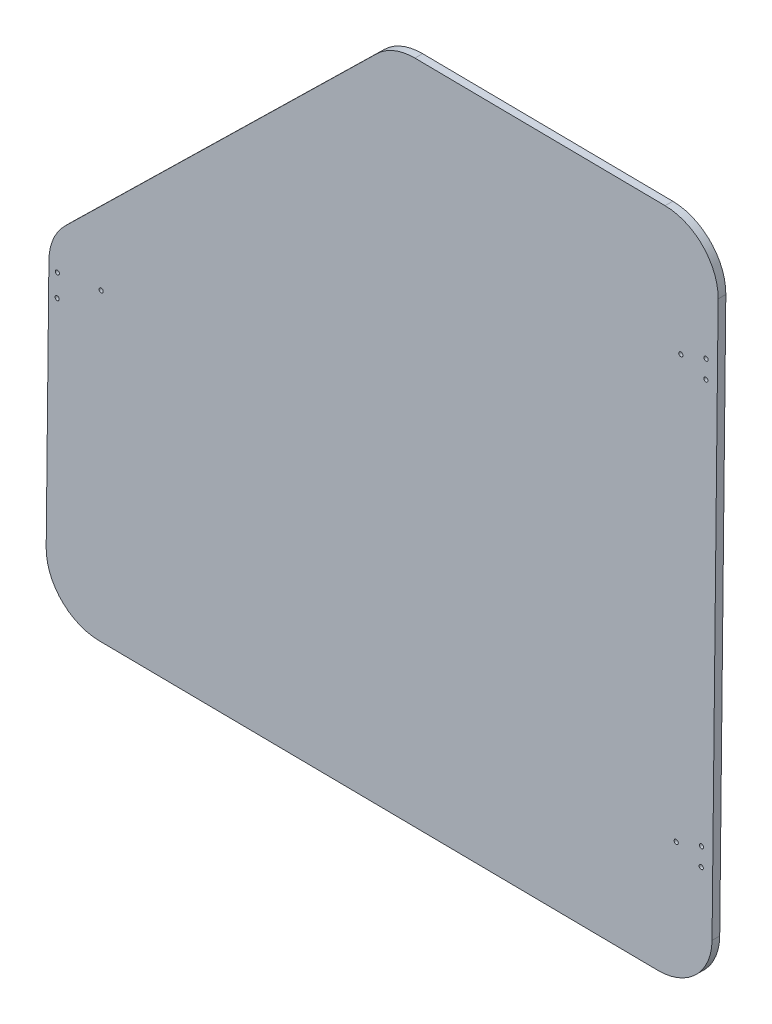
from build123d import *

# Parameters (mm, degrees)
BOSS_EXTRUDE1_DEPTH = 8.73125
SKETCH2_R           = 2.38125
CUT_EXTRUDE1_DEPTH  = 1004.067350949


with BuildPart() as part:
    # Sketch1 → Boss-Extrude1 (new body)
    with BuildSketch(Plane.XY):
        with BuildLine():
            Line((-704.447852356, 303.914359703), (-707.558926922, 19.510658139))
            ThreePointArc((-707.558926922, 19.510658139), (-690.176721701, -23.787293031), (-647.269371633, -42.11249273))
            Line((-647.269371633, -42.11249273), (-12.307360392, -49.058303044))
            ThreePointArc((-12.307360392, -49.058303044), (30.990590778, -31.676097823), (49.315790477, 11.231252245))
            Line((49.315790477, 11.231252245), (56.261600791, 646.193263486))
            ThreePointArc((56.261600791, 646.193263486), (38.879395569, 689.491214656), (-4.027954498, 707.816414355))
            Line((-4.027954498, 707.816414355), (-288.431656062, 710.927488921))
            ThreePointArc((-288.431656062, 710.927488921), (-311.809399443, 706.542635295), (-331.729607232, 693.5452837))
            Line((-331.729607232, 693.5452837), (-686.122652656, 346.821709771))
            ThreePointArc((-686.122652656, 346.821709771), (-699.552653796, 327.190589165), (-704.447852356, 303.914359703))
        make_face()
    extrude(amount=-BOSS_EXTRUDE1_DEPTH)

    # Sketch2 → Cut-Extrude1 (cut, through all)
    with BuildSketch(Plane.XY):
        with Locations((37.021406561, 77.250931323)):
            Circle(SKETCH2_R)
        with Locations((8.560985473, 87.881625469)):
            Circle(SKETCH2_R)
        with Locations((37.247145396, 97.887196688)):
            Circle(SKETCH2_R)
        with Locations((42.300222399, 559.822059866)):
            Circle(SKETCH2_R)
        with Locations((42.525961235, 580.458325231)):
            Circle(SKETCH2_R)
        with Locations((13.839801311, 570.452754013)):
            Circle(SKETCH2_R)
        with Locations((-695.126934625, 271.273052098)):
            Circle(SKETCH2_R)
        with Locations((-694.849102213, 296.671532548)):
            Circle(SKETCH2_R)
        with Locations((-645.052766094, 303.914359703)):
            Circle(SKETCH2_R)
    extrude(amount=-CUT_EXTRUDE1_DEPTH, mode=Mode.SUBTRACT)


solid = part.part
